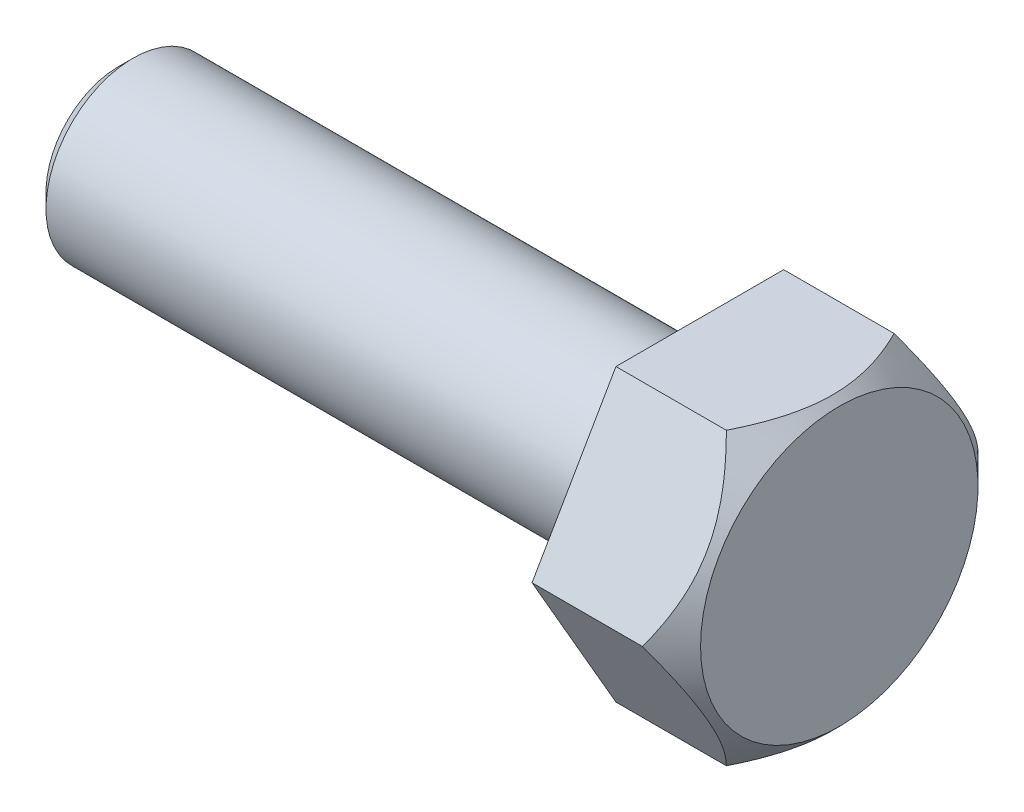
from build123d import *

# Parameters (mm, degrees)
ESQUISSE4_R              = 3
BASE_EXTRUSION_DEPTH     = 20
BOSSAGE_EXTRUSION1_DEPTH = 4.8
CHANFREIN1_SIZE          = 0.5


with BuildPart() as part:
    # Esquisse4 → Base-Extrusion (new body)
    with BuildSketch(Plane(origin=(0, 0, 0), x_dir=(0, 0, -1), z_dir=(1, 0, 0))):
        Circle(ESQUISSE4_R)
    extrude(amount=-BASE_EXTRUSION_DEPTH)

    # Esquisse7 → Bossage-Extrusion1 (add)
    with BuildSketch(Plane(origin=(0, 0, 0), x_dir=(0, 0, -1), z_dir=(1, 0, 0))):
        Polygon((-2.886751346, 5), (2.886751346, 5), (5.773502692, 0), (2.886751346, -5), (-2.886751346, -5), (-5.773502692, 0), align=None)
    extrude(amount=BOSSAGE_EXTRUSION1_DEPTH)

    # Chanfrein1
    chanfrein1_edges = [part.edges().sort_by_distance(p)[0] for p in [
        (-20, 0, 3),
    ]]
    chamfer(chanfrein1_edges, length=CHANFREIN1_SIZE)

    # Couper-Balayage2: sweep along a path in Esquisse13
    with BuildLine(Plane(origin=(4.8, 0, 0), x_dir=(0, 0, -1), z_dir=(1, 0, 0))) as couper_balayage2_path:
        CenterArc((0, 0), 5, 0, 360)
    # Esquisse12 → Couper-Balayage2 (sweep, cut)
    with BuildSketch(Plane(origin=(0, 0, 0), x_dir=(1, 0, 0), z_dir=(0, 1, 0))):
        Polygon((4.8, 5.773502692), (3.8, 5.773502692), (4.8, 4.773502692), align=None)
    sweep(path=couper_balayage2_path.line, mode=Mode.SUBTRACT)


solid = part.part
